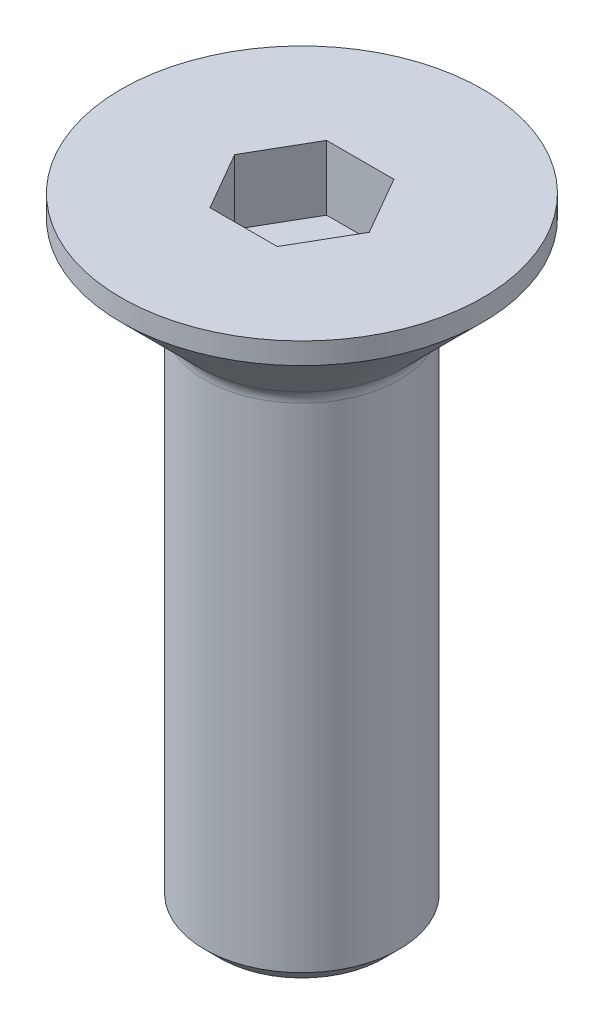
ISO-10303-21;
HEADER;
FILE_DESCRIPTION(('STEP AP214'),'2;1');
FILE_NAME('part.step','',(''),(''),'','','');
FILE_SCHEMA(('AUTOMOTIVE_DESIGN { 1 0 10303 214 1 1 1 1 }'));
ENDSEC;
DATA;
#1=APPLICATION_CONTEXT('core data for automotive mechanical design processes');
#2=APPLICATION_PROTOCOL_DEFINITION('international standard','automotive_design',2000,#1);
#3=PRODUCT_CONTEXT('',#1,'mechanical');
#4=PRODUCT('Part','Part','',(#3));
#5=PRODUCT_RELATED_PRODUCT_CATEGORY('part','',(#4));
#6=PRODUCT_DEFINITION_FORMATION('','',#4);
#7=PRODUCT_DEFINITION_CONTEXT('part definition',#1,'design');
#8=PRODUCT_DEFINITION('design','',#6,#7);
#9=PRODUCT_DEFINITION_SHAPE('','',#8);
#10=(LENGTH_UNIT() NAMED_UNIT(*) SI_UNIT(.MILLI.,.METRE.));
#11=(NAMED_UNIT(*) PLANE_ANGLE_UNIT() SI_UNIT($,.RADIAN.));
#12=(NAMED_UNIT(*) SI_UNIT($,.STERADIAN.) SOLID_ANGLE_UNIT());
#13=UNCERTAINTY_MEASURE_WITH_UNIT(LENGTH_MEASURE(1.E-05),#10,'distance_accuracy_value','');
#14=(GEOMETRIC_REPRESENTATION_CONTEXT(3) GLOBAL_UNCERTAINTY_ASSIGNED_CONTEXT((#13)) GLOBAL_UNIT_ASSIGNED_CONTEXT((#10,
#11,#12)) REPRESENTATION_CONTEXT('',''));
#15=CARTESIAN_POINT('',(0.,0.,0.));
#16=DIRECTION('',(0.,0.,1.));
#17=DIRECTION('',(1.,0.,0.));
#18=AXIS2_PLACEMENT_3D('',#15,#16,#17);
#19=CARTESIAN_POINT('',(0.,-2.90710678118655,0.));
#20=DIRECTION('',(0.,1.,0.));
#21=DIRECTION('',(-1.,0.,0.));
#22=AXIS2_PLACEMENT_3D('',#19,#20,#21);
#23=TOROIDAL_SURFACE('',#22,3.,0.499999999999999);
#24=CARTESIAN_POINT('',(0.,-2.55355339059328,0.));
#25=DIRECTION('',(0.,1.,0.));
#26=DIRECTION('',(-1.,0.,0.));
#27=AXIS2_PLACEMENT_3D('',#24,#25,#26);
#28=CIRCLE('',#27,2.64644660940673);
#29=CARTESIAN_POINT('',(-2.64644660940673,-2.55355339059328,0.));
#30=VERTEX_POINT('',#29);
#31=EDGE_CURVE('E11',#30,#30,#28,.T.);
#32=ORIENTED_EDGE('',*,*,#31,.F.);
#33=EDGE_LOOP('',(#32));
#34=FACE_BOUND('',#33,.T.);
#35=CARTESIAN_POINT('',(0.,-2.90710678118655,0.));
#36=DIRECTION('',(0.,1.,0.));
#37=DIRECTION('',(-1.,0.,0.));
#38=AXIS2_PLACEMENT_3D('',#35,#36,#37);
#39=CIRCLE('',#38,2.5);
#40=CARTESIAN_POINT('',(-2.5,-2.90710678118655,0.));
#41=VERTEX_POINT('',#40);
#42=EDGE_CURVE('E142',#41,#41,#39,.T.);
#43=ORIENTED_EDGE('',*,*,#42,.T.);
#44=EDGE_LOOP('',(#43));
#45=FACE_BOUND('',#44,.T.);
#46=ADVANCED_FACE('F39',(#34,#45),#23,.F.);
#47=CARTESIAN_POINT('',(0.,-2.55355339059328,0.));
#48=DIRECTION('',(0.,1.,0.));
#49=DIRECTION('',(-1.,0.,0.));
#50=AXIS2_PLACEMENT_3D('',#47,#48,#49);
#51=CONICAL_SURFACE('',#50,2.64644660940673,0.78539816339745);
#52=CARTESIAN_POINT('',(0.,-0.550000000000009,0.));
#53=DIRECTION('',(0.,1.,0.));
#54=DIRECTION('',(-1.,0.,0.));
#55=AXIS2_PLACEMENT_3D('',#52,#53,#54);
#56=CIRCLE('',#55,4.65);
#57=CARTESIAN_POINT('',(-4.65,-0.550000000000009,0.));
#58=VERTEX_POINT('',#57);
#59=EDGE_CURVE('E47',#58,#58,#56,.T.);
#60=ORIENTED_EDGE('',*,*,#59,.F.);
#61=EDGE_LOOP('',(#60));
#62=FACE_BOUND('',#61,.T.);
#63=ORIENTED_EDGE('',*,*,#31,.T.);
#64=EDGE_LOOP('',(#63));
#65=FACE_BOUND('',#64,.T.);
#66=ADVANCED_FACE('F165',(#62,#65),#51,.T.);
#67=CARTESIAN_POINT('',(0.,0.,0.));
#68=DIRECTION('',(0.,1.,0.));
#69=DIRECTION('',(-1.,0.,0.));
#70=AXIS2_PLACEMENT_3D('',#67,#68,#69);
#71=CYLINDRICAL_SURFACE('',#70,4.65);
#72=CARTESIAN_POINT('',(0.,0.,0.));
#73=DIRECTION('',(0.,1.,0.));
#74=DIRECTION('',(-1.,0.,0.));
#75=AXIS2_PLACEMENT_3D('',#72,#73,#74);
#76=CIRCLE('',#75,4.65);
#77=CARTESIAN_POINT('',(-4.65,0.,0.));
#78=VERTEX_POINT('',#77);
#79=EDGE_CURVE('E157',#78,#78,#76,.T.);
#80=ORIENTED_EDGE('',*,*,#79,.F.);
#81=EDGE_LOOP('',(#80));
#82=FACE_BOUND('',#81,.T.);
#83=ORIENTED_EDGE('',*,*,#59,.T.);
#84=EDGE_LOOP('',(#83));
#85=FACE_BOUND('',#84,.T.);
#86=ADVANCED_FACE('F163',(#82,#85),#71,.T.);
#87=CARTESIAN_POINT('',(4.65,0.,0.));
#88=DIRECTION('',(0.,-1.,0.));
#89=DIRECTION('',(1.,0.,0.));
#90=AXIS2_PLACEMENT_3D('',#87,#88,#89);
#91=PLANE('',#90);
#92=DIRECTION('',(-0.5,0.,-0.866025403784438));
#93=VECTOR('',#92,1.);
#94=CARTESIAN_POINT('',(1.73205080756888,0.,0.));
#95=LINE('',#94,#93);
#96=CARTESIAN_POINT('',(1.73205080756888,0.,0.));
#97=VERTEX_POINT('',#96);
#98=CARTESIAN_POINT('',(0.866025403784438,0.,-1.5));
#99=VERTEX_POINT('',#98);
#100=EDGE_CURVE('E128',#97,#99,#95,.T.);
#101=ORIENTED_EDGE('',*,*,#100,.F.);
#102=DIRECTION('',(0.5,0.,-0.866025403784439));
#103=VECTOR('',#102,1.);
#104=CARTESIAN_POINT('',(0.866025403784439,0.,1.5));
#105=LINE('',#104,#103);
#106=CARTESIAN_POINT('',(0.866025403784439,0.,1.5));
#107=VERTEX_POINT('',#106);
#108=EDGE_CURVE('E54',#107,#97,#105,.T.);
#109=ORIENTED_EDGE('',*,*,#108,.F.);
#110=DIRECTION('',(1.,0.,0.));
#111=VECTOR('',#110,1.);
#112=CARTESIAN_POINT('',(-0.866025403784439,0.,1.5));
#113=LINE('',#112,#111);
#114=CARTESIAN_POINT('',(-0.866025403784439,0.,1.5));
#115=VERTEX_POINT('',#114);
#116=EDGE_CURVE('E138',#115,#107,#113,.T.);
#117=ORIENTED_EDGE('',*,*,#116,.F.);
#118=DIRECTION('',(0.5,0.,0.866025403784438));
#119=VECTOR('',#118,1.);
#120=CARTESIAN_POINT('',(-1.73205080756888,0.,0.));
#121=LINE('',#120,#119);
#122=CARTESIAN_POINT('',(-1.73205080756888,0.,0.));
#123=VERTEX_POINT('',#122);
#124=EDGE_CURVE('E135',#123,#115,#121,.T.);
#125=ORIENTED_EDGE('',*,*,#124,.F.);
#126=DIRECTION('',(-0.5,0.,0.866025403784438));
#127=VECTOR('',#126,1.);
#128=CARTESIAN_POINT('',(-0.866025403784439,0.,-1.5));
#129=LINE('',#128,#127);
#130=CARTESIAN_POINT('',(-0.866025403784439,0.,-1.5));
#131=VERTEX_POINT('',#130);
#132=EDGE_CURVE('E102',#131,#123,#129,.T.);
#133=ORIENTED_EDGE('',*,*,#132,.F.);
#134=DIRECTION('',(-1.,0.,0.));
#135=VECTOR('',#134,1.);
#136=CARTESIAN_POINT('',(0.866025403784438,0.,-1.5));
#137=LINE('',#136,#135);
#138=EDGE_CURVE('E131',#99,#131,#137,.T.);
#139=ORIENTED_EDGE('',*,*,#138,.F.);
#140=EDGE_LOOP('',(#101,#109,#117,#125,#133,#139));
#141=FACE_BOUND('',#140,.T.);
#142=ORIENTED_EDGE('',*,*,#79,.T.);
#143=EDGE_LOOP('',(#142));
#144=FACE_BOUND('',#143,.T.);
#145=ADVANCED_FACE('F189',(#141,#144),#91,.F.);
#146=CARTESIAN_POINT('',(2.1,-16.,0.));
#147=DIRECTION('',(0.,1.,0.));
#148=DIRECTION('',(-1.,0.,0.));
#149=AXIS2_PLACEMENT_3D('',#146,#147,#148);
#150=PLANE('',#149);
#151=CARTESIAN_POINT('',(0.,-16.,0.));
#152=DIRECTION('',(0.,1.,0.));
#153=DIRECTION('',(-1.,0.,0.));
#154=AXIS2_PLACEMENT_3D('',#151,#152,#153);
#155=CIRCLE('',#154,2.1);
#156=CARTESIAN_POINT('',(-2.1,-16.,0.));
#157=VERTEX_POINT('',#156);
#158=EDGE_CURVE('E154',#157,#157,#155,.T.);
#159=ORIENTED_EDGE('',*,*,#158,.F.);
#160=EDGE_LOOP('',(#159));
#161=FACE_BOUND('',#160,.T.);
#162=ADVANCED_FACE('F184',(#161),#150,.F.);
#163=CARTESIAN_POINT('',(0.,-16.,0.));
#164=DIRECTION('',(0.,1.,0.));
#165=DIRECTION('',(-1.,0.,0.));
#166=AXIS2_PLACEMENT_3D('',#163,#164,#165);
#167=CONICAL_SURFACE('',#166,2.1,0.785398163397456);
#168=CARTESIAN_POINT('',(0.,-15.6,0.));
#169=DIRECTION('',(0.,1.,0.));
#170=DIRECTION('',(-1.,0.,0.));
#171=AXIS2_PLACEMENT_3D('',#168,#169,#170);
#172=CIRCLE('',#171,2.5);
#173=CARTESIAN_POINT('',(-2.5,-15.6,0.));
#174=VERTEX_POINT('',#173);
#175=EDGE_CURVE('E151',#174,#174,#172,.T.);
#176=ORIENTED_EDGE('',*,*,#175,.F.);
#177=EDGE_LOOP('',(#176));
#178=FACE_BOUND('',#177,.T.);
#179=ORIENTED_EDGE('',*,*,#158,.T.);
#180=EDGE_LOOP('',(#179));
#181=FACE_BOUND('',#180,.T.);
#182=ADVANCED_FACE('F178',(#178,#181),#167,.T.);
#183=CARTESIAN_POINT('',(0.,0.,0.));
#184=DIRECTION('',(0.,1.,0.));
#185=DIRECTION('',(-1.,0.,0.));
#186=AXIS2_PLACEMENT_3D('',#183,#184,#185);
#187=CYLINDRICAL_SURFACE('',#186,2.5);
#188=ORIENTED_EDGE('',*,*,#42,.F.);
#189=EDGE_LOOP('',(#188));
#190=FACE_BOUND('',#189,.T.);
#191=ORIENTED_EDGE('',*,*,#175,.T.);
#192=EDGE_LOOP('',(#191));
#193=FACE_BOUND('',#192,.T.);
#194=ADVANCED_FACE('F174',(#190,#193),#187,.T.);
#195=CARTESIAN_POINT('',(0.866025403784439,-1.66666666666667,1.5));
#196=DIRECTION('',(0.866025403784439,0.,0.5));
#197=DIRECTION('',(0.5,0.,-0.866025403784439));
#198=AXIS2_PLACEMENT_3D('',#195,#196,#197);
#199=PLANE('',#198);
#200=ORIENTED_EDGE('',*,*,#108,.T.);
#201=DIRECTION('',(0.,1.,0.));
#202=VECTOR('',#201,1.);
#203=CARTESIAN_POINT('',(1.73205080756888,-1.66666666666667,0.));
#204=LINE('',#203,#202);
#205=CARTESIAN_POINT('',(1.73205080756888,-1.66666666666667,0.));
#206=VERTEX_POINT('',#205);
#207=EDGE_CURVE('E84',#206,#97,#204,.T.);
#208=ORIENTED_EDGE('',*,*,#207,.F.);
#209=DIRECTION('',(0.5,0.,-0.866025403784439));
#210=VECTOR('',#209,1.);
#211=CARTESIAN_POINT('',(0.866025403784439,-1.66666666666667,1.5));
#212=LINE('',#211,#210);
#213=CARTESIAN_POINT('',(0.866025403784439,-1.66666666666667,1.5));
#214=VERTEX_POINT('',#213);
#215=EDGE_CURVE('E140',#214,#206,#212,.T.);
#216=ORIENTED_EDGE('',*,*,#215,.F.);
#217=DIRECTION('',(0.,1.,0.));
#218=VECTOR('',#217,1.);
#219=CARTESIAN_POINT('',(0.866025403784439,-1.66666666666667,1.5));
#220=LINE('',#219,#218);
#221=EDGE_CURVE('E62',#214,#107,#220,.T.);
#222=ORIENTED_EDGE('',*,*,#221,.T.);
#223=EDGE_LOOP('',(#200,#208,#216,#222));
#224=FACE_BOUND('',#223,.T.);
#225=ADVANCED_FACE('F177',(#224),#199,.F.);
#226=CARTESIAN_POINT('',(-0.866025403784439,-1.66666666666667,1.5));
#227=DIRECTION('',(0.,0.,1.));
#228=DIRECTION('',(1.,0.,0.));
#229=AXIS2_PLACEMENT_3D('',#226,#227,#228);
#230=PLANE('',#229);
#231=ORIENTED_EDGE('',*,*,#116,.T.);
#232=ORIENTED_EDGE('',*,*,#221,.F.);
#233=DIRECTION('',(1.,0.,0.));
#234=VECTOR('',#233,1.);
#235=CARTESIAN_POINT('',(-0.866025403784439,-1.66666666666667,1.5));
#236=LINE('',#235,#234);
#237=CARTESIAN_POINT('',(-0.866025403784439,-1.66666666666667,1.5));
#238=VERTEX_POINT('',#237);
#239=EDGE_CURVE('E114',#238,#214,#236,.T.);
#240=ORIENTED_EDGE('',*,*,#239,.F.);
#241=DIRECTION('',(0.,1.,0.));
#242=VECTOR('',#241,1.);
#243=CARTESIAN_POINT('',(-0.866025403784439,-1.66666666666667,1.5));
#244=LINE('',#243,#242);
#245=EDGE_CURVE('E106',#238,#115,#244,.T.);
#246=ORIENTED_EDGE('',*,*,#245,.T.);
#247=EDGE_LOOP('',(#231,#232,#240,#246));
#248=FACE_BOUND('',#247,.T.);
#249=ADVANCED_FACE('F258',(#248),#230,.F.);
#250=CARTESIAN_POINT('',(-1.73205080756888,-1.66666666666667,0.));
#251=DIRECTION('',(-0.866025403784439,0.,0.5));
#252=DIRECTION('',(0.5,0.,0.866025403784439));
#253=AXIS2_PLACEMENT_3D('',#250,#251,#252);
#254=PLANE('',#253);
#255=ORIENTED_EDGE('',*,*,#124,.T.);
#256=ORIENTED_EDGE('',*,*,#245,.F.);
#257=DIRECTION('',(0.5,0.,0.866025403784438));
#258=VECTOR('',#257,1.);
#259=CARTESIAN_POINT('',(-1.73205080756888,-1.66666666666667,0.));
#260=LINE('',#259,#258);
#261=CARTESIAN_POINT('',(-1.73205080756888,-1.66666666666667,0.));
#262=VERTEX_POINT('',#261);
#263=EDGE_CURVE('E110',#262,#238,#260,.T.);
#264=ORIENTED_EDGE('',*,*,#263,.F.);
#265=DIRECTION('',(0.,1.,0.));
#266=VECTOR('',#265,1.);
#267=CARTESIAN_POINT('',(-1.73205080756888,-1.66666666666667,0.));
#268=LINE('',#267,#266);
#269=EDGE_CURVE('E95',#262,#123,#268,.T.);
#270=ORIENTED_EDGE('',*,*,#269,.T.);
#271=EDGE_LOOP('',(#255,#256,#264,#270));
#272=FACE_BOUND('',#271,.T.);
#273=ADVANCED_FACE('F111',(#272),#254,.F.);
#274=CARTESIAN_POINT('',(-0.866025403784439,-1.66666666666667,-1.5));
#275=DIRECTION('',(-0.866025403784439,0.,-0.5));
#276=DIRECTION('',(-0.5,0.,0.866025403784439));
#277=AXIS2_PLACEMENT_3D('',#274,#275,#276);
#278=PLANE('',#277);
#279=ORIENTED_EDGE('',*,*,#132,.T.);
#280=ORIENTED_EDGE('',*,*,#269,.F.);
#281=DIRECTION('',(-0.5,0.,0.866025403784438));
#282=VECTOR('',#281,1.);
#283=CARTESIAN_POINT('',(-0.866025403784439,-1.66666666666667,-1.5));
#284=LINE('',#283,#282);
#285=CARTESIAN_POINT('',(-0.866025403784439,-1.66666666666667,-1.5));
#286=VERTEX_POINT('',#285);
#287=EDGE_CURVE('E99',#286,#262,#284,.T.);
#288=ORIENTED_EDGE('',*,*,#287,.F.);
#289=DIRECTION('',(0.,1.,0.));
#290=VECTOR('',#289,1.);
#291=CARTESIAN_POINT('',(-0.866025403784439,-1.66666666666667,-1.5));
#292=LINE('',#291,#290);
#293=EDGE_CURVE('E107',#286,#131,#292,.T.);
#294=ORIENTED_EDGE('',*,*,#293,.T.);
#295=EDGE_LOOP('',(#279,#280,#288,#294));
#296=FACE_BOUND('',#295,.T.);
#297=ADVANCED_FACE('F97',(#296),#278,.F.);
#298=CARTESIAN_POINT('',(0.866025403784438,-1.66666666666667,-1.5));
#299=DIRECTION('',(0.,0.,-1.));
#300=DIRECTION('',(-1.,0.,0.));
#301=AXIS2_PLACEMENT_3D('',#298,#299,#300);
#302=PLANE('',#301);
#303=ORIENTED_EDGE('',*,*,#138,.T.);
#304=ORIENTED_EDGE('',*,*,#293,.F.);
#305=DIRECTION('',(-1.,0.,0.));
#306=VECTOR('',#305,1.);
#307=CARTESIAN_POINT('',(0.866025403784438,-1.66666666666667,-1.5));
#308=LINE('',#307,#306);
#309=CARTESIAN_POINT('',(0.866025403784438,-1.66666666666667,-1.5));
#310=VERTEX_POINT('',#309);
#311=EDGE_CURVE('E120',#310,#286,#308,.T.);
#312=ORIENTED_EDGE('',*,*,#311,.F.);
#313=DIRECTION('',(0.,1.,0.));
#314=VECTOR('',#313,1.);
#315=CARTESIAN_POINT('',(0.866025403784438,-1.66666666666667,-1.5));
#316=LINE('',#315,#314);
#317=EDGE_CURVE('E145',#310,#99,#316,.T.);
#318=ORIENTED_EDGE('',*,*,#317,.T.);
#319=EDGE_LOOP('',(#303,#304,#312,#318));
#320=FACE_BOUND('',#319,.T.);
#321=ADVANCED_FACE('F280',(#320),#302,.F.);
#322=CARTESIAN_POINT('',(1.73205080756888,-1.66666666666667,0.));
#323=DIRECTION('',(0.866025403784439,0.,-0.5));
#324=DIRECTION('',(-0.5,0.,-0.866025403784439));
#325=AXIS2_PLACEMENT_3D('',#322,#323,#324);
#326=PLANE('',#325);
#327=ORIENTED_EDGE('',*,*,#100,.T.);
#328=ORIENTED_EDGE('',*,*,#317,.F.);
#329=DIRECTION('',(-0.5,0.,-0.866025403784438));
#330=VECTOR('',#329,1.);
#331=CARTESIAN_POINT('',(1.73205080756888,-1.66666666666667,0.));
#332=LINE('',#331,#330);
#333=EDGE_CURVE('E122',#206,#310,#332,.T.);
#334=ORIENTED_EDGE('',*,*,#333,.F.);
#335=ORIENTED_EDGE('',*,*,#207,.T.);
#336=EDGE_LOOP('',(#327,#328,#334,#335));
#337=FACE_BOUND('',#336,.T.);
#338=ADVANCED_FACE('F288',(#337),#326,.F.);
#339=CARTESIAN_POINT('',(0.866025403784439,-1.66666666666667,1.5));
#340=DIRECTION('',(0.,-1.,0.));
#341=DIRECTION('',(1.,0.,0.));
#342=AXIS2_PLACEMENT_3D('',#339,#340,#341);
#343=PLANE('',#342);
#344=ORIENTED_EDGE('',*,*,#215,.T.);
#345=ORIENTED_EDGE('',*,*,#333,.T.);
#346=ORIENTED_EDGE('',*,*,#311,.T.);
#347=ORIENTED_EDGE('',*,*,#287,.T.);
#348=ORIENTED_EDGE('',*,*,#263,.T.);
#349=ORIENTED_EDGE('',*,*,#239,.T.);
#350=EDGE_LOOP('',(#344,#345,#346,#347,#348,#349));
#351=FACE_BOUND('',#350,.T.);
#352=ADVANCED_FACE('F117',(#351),#343,.F.);
#353=CLOSED_SHELL('',(#46,#66,#86,#145,#162,#182,#194,#225,#249,#273,#297,#321,#338,#352));
#354=MANIFOLD_SOLID_BREP('B2',#353);
#355=ADVANCED_BREP_SHAPE_REPRESENTATION('',(#18,#354),#14);
#356=SHAPE_DEFINITION_REPRESENTATION(#9,#355);
ENDSEC;
END-ISO-10303-21;
